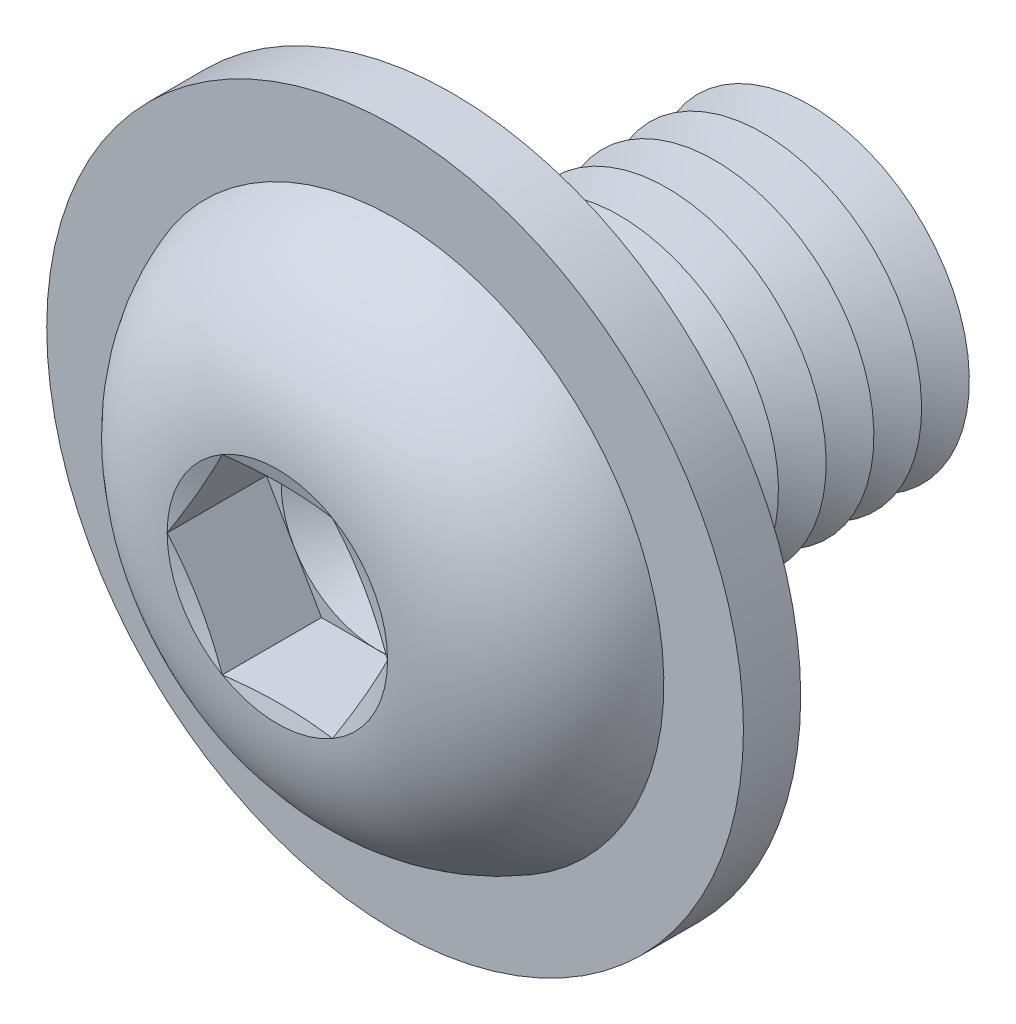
from build123d import *

# Parameters (mm, degrees)
FILLET1_R           = 0.75
LPATTERN1_COUNT     = 8
LPATTERN1_PITCH     = 1.5
CUT_EXTRUDE1_DEPTH  = 3.12
SKETCH5_R           = 10.95
SKETCH5_R_2         = 5.75
BOSS_EXTRUDE1_DEPTH = 1.8


with BuildPart() as part:
    # Sketch1 → Revolve1 (revolve)
    with BuildSketch(Plane(origin=(0, 0, 0), x_dir=(0, 0, -1), z_dir=(1, 0, 0))):
        with BuildLine():
            Line((0, 5), (0, 8.75))
            ThreePointArc((0, 8.75), (-3.814142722, 7.21429474), (-5.5, 3.4641))
            Line((-5.5, 3.4641), (-5.035898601, 1.73205))
            Line((-5.035898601, 1.73205), (-5.5, 1.73205))
            Line((-5.5, 1.73205), (-5.5, 0))
            Line((-5.5, 0), (12, 0))
            Line((12, 0), (12, 5))
            Line((12, 5), (0, 5))
        make_face()
    revolve(axis=Axis((0, 0, -12), (0, 0, 1)))

    # Fillet1
    fillet1_edges = [part.edges().sort_by_distance(p)[0] for p in [
        (0, -5, 0),
    ]]
    fillet(fillet1_edges, radius=FILLET1_R)

    # Sketch2 → Cut-Revolve1 (revolve, cut)
    with BuildSketch(Plane(origin=(0, 0, 0), x_dir=(0, 0, -1), z_dir=(1, 0, 0))):
        Polygon((11.25, 5), (12.75, 5), (12, 3.700961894), align=None)
    cut_revolve1 = revolve(axis=Axis((0, 0, -12), (0, 0, -1)), mode=Mode.SUBTRACT)

    # LPattern1: Cut-Revolve1 ×8
    with Locations(*[(0, 0, i * LPATTERN1_PITCH) for i in range(1, LPATTERN1_COUNT)]):
        add(cut_revolve1, mode=Mode.SUBTRACT)

    # Sketch3 → Cut-Extrude1 (cut)
    with BuildSketch(Plane.XY.offset(5.5)):
        Polygon((1.73205, 2.999998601), (-1.73205, 2.999998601), (-3.4641, 0), (-1.73205, -2.999998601), (1.73205, -2.999998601), (3.4641, 0), align=None)
    extrude(amount=-CUT_EXTRUDE1_DEPTH, mode=Mode.SUBTRACT)

    # Cut-Extrude2 cone 1 section (on through the dimple's axis) → Cut-Extrude2 (revolve, cut)
    with BuildSketch(Plane(origin=(0, 0, 2.38), x_dir=(0, -1, 0), z_dir=(1, 0, 0))):
        Polygon((0, 0), (2.999998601, 0), (0, 1.73205), align=None)
    revolve(axis=Axis((0, 0, 2.38), (0, 0, -1)), mode=Mode.SUBTRACT)

    # Sketch5 → Boss-Extrude1 (add)
    with BuildSketch(Plane(origin=(0, 0, 0), x_dir=(-1, 0, 0), z_dir=(0, 0, -1))):
        with Locations(Location((0, 0, 0), (0, 0, 90))):
            Circle(SKETCH5_R)
        Circle(SKETCH5_R_2, mode=Mode.SUBTRACT)
    extrude(amount=-BOSS_EXTRUDE1_DEPTH)


solid = part.part
